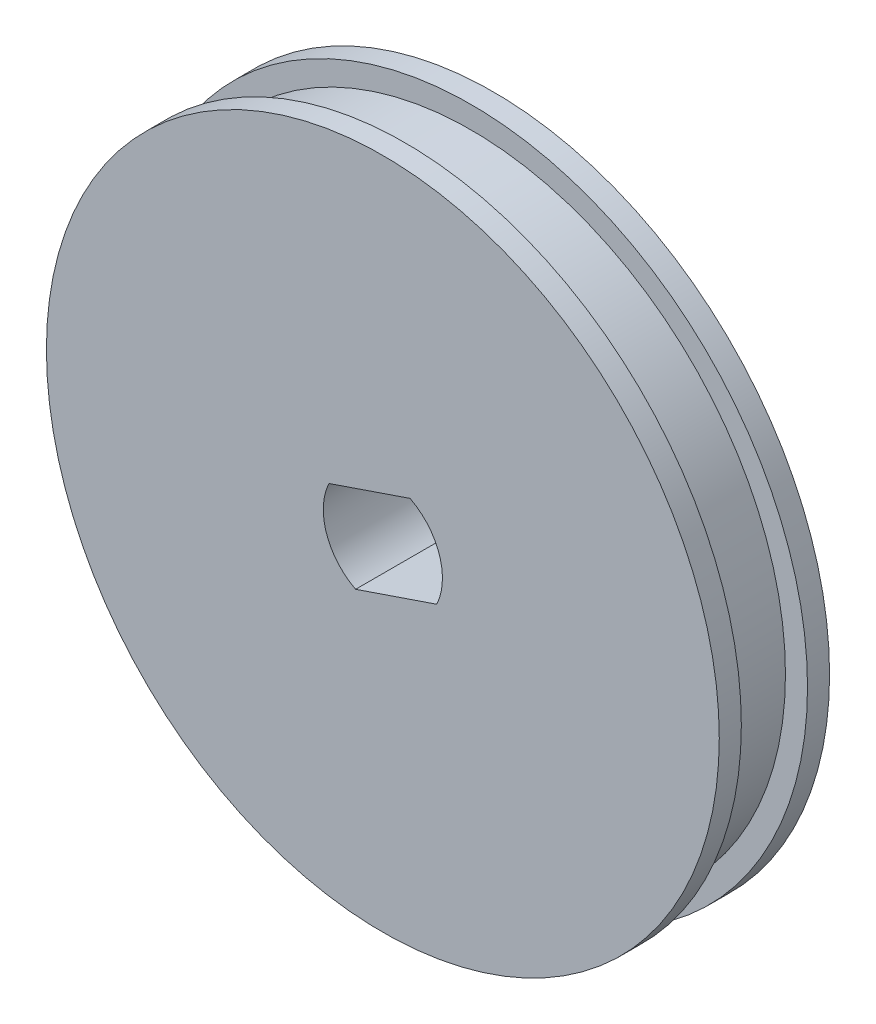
ISO-10303-21;
HEADER;
FILE_DESCRIPTION(('STEP AP214'),'2;1');
FILE_NAME('part.step','',(''),(''),'','','');
FILE_SCHEMA(('AUTOMOTIVE_DESIGN { 1 0 10303 214 1 1 1 1 }'));
ENDSEC;
DATA;
#1=APPLICATION_CONTEXT('core data for automotive mechanical design processes');
#2=APPLICATION_PROTOCOL_DEFINITION('international standard','automotive_design',2000,#1);
#3=PRODUCT_CONTEXT('',#1,'mechanical');
#4=PRODUCT('Part','Part','',(#3));
#5=PRODUCT_RELATED_PRODUCT_CATEGORY('part','',(#4));
#6=PRODUCT_DEFINITION_FORMATION('','',#4);
#7=PRODUCT_DEFINITION_CONTEXT('part definition',#1,'design');
#8=PRODUCT_DEFINITION('design','',#6,#7);
#9=PRODUCT_DEFINITION_SHAPE('','',#8);
#10=(LENGTH_UNIT() NAMED_UNIT(*) SI_UNIT(.MILLI.,.METRE.));
#11=(NAMED_UNIT(*) PLANE_ANGLE_UNIT() SI_UNIT($,.RADIAN.));
#12=(NAMED_UNIT(*) SI_UNIT($,.STERADIAN.) SOLID_ANGLE_UNIT());
#13=UNCERTAINTY_MEASURE_WITH_UNIT(LENGTH_MEASURE(1.E-05),#10,'distance_accuracy_value','');
#14=(GEOMETRIC_REPRESENTATION_CONTEXT(3) GLOBAL_UNCERTAINTY_ASSIGNED_CONTEXT((#13)) GLOBAL_UNIT_ASSIGNED_CONTEXT((#10,
#11,#12)) REPRESENTATION_CONTEXT('',''));
#15=CARTESIAN_POINT('',(0.,0.,0.));
#16=DIRECTION('',(0.,0.,1.));
#17=DIRECTION('',(1.,0.,0.));
#18=AXIS2_PLACEMENT_3D('',#15,#16,#17);
#19=CARTESIAN_POINT('',(22.4165324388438,-13.7076740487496,1.5));
#20=DIRECTION('',(0.,0.,-1.));
#21=DIRECTION('',(-1.,0.,0.));
#22=AXIS2_PLACEMENT_3D('',#19,#20,#21);
#23=CYLINDRICAL_SURFACE('',#22,14.25);
#24=CARTESIAN_POINT('',(22.4165324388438,-13.7076740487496,1.5));
#25=DIRECTION('',(0.,0.,1.));
#26=DIRECTION('',(1.,0.,0.));
#27=AXIS2_PLACEMENT_3D('',#24,#25,#26);
#28=CIRCLE('',#27,14.25);
#29=CARTESIAN_POINT('',(36.6665324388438,-13.7076740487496,1.5));
#30=VERTEX_POINT('',#29);
#31=EDGE_CURVE('E11',#30,#30,#28,.T.);
#32=ORIENTED_EDGE('',*,*,#31,.F.);
#33=EDGE_LOOP('',(#32));
#34=FACE_BOUND('',#33,.T.);
#35=CARTESIAN_POINT('',(22.4165324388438,-13.7076740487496,-1.5));
#36=DIRECTION('',(0.,0.,1.));
#37=DIRECTION('',(1.,0.,0.));
#38=AXIS2_PLACEMENT_3D('',#35,#36,#37);
#39=CIRCLE('',#38,14.25);
#40=CARTESIAN_POINT('',(36.6665324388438,-13.7076740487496,-1.5));
#41=VERTEX_POINT('',#40);
#42=EDGE_CURVE('E44',#41,#41,#39,.T.);
#43=ORIENTED_EDGE('',*,*,#42,.T.);
#44=EDGE_LOOP('',(#43));
#45=FACE_BOUND('',#44,.T.);
#46=ADVANCED_FACE('F41',(#34,#45),#23,.T.);
#47=CARTESIAN_POINT('',(22.4165324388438,-13.7076740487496,2.5));
#48=DIRECTION('',(0.,0.,-1.));
#49=DIRECTION('',(-1.,0.,0.));
#50=AXIS2_PLACEMENT_3D('',#47,#48,#49);
#51=CYLINDRICAL_SURFACE('',#50,15.25);
#52=CARTESIAN_POINT('',(22.4165324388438,-13.7076740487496,2.5));
#53=DIRECTION('',(0.,0.,1.));
#54=DIRECTION('',(1.,0.,0.));
#55=AXIS2_PLACEMENT_3D('',#52,#53,#54);
#56=CIRCLE('',#55,15.25);
#57=CARTESIAN_POINT('',(37.6665324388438,-13.7076740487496,2.5));
#58=VERTEX_POINT('',#57);
#59=EDGE_CURVE('E49',#58,#58,#56,.T.);
#60=ORIENTED_EDGE('',*,*,#59,.F.);
#61=EDGE_LOOP('',(#60));
#62=FACE_BOUND('',#61,.T.);
#63=CARTESIAN_POINT('',(22.4165324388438,-13.7076740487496,1.5));
#64=DIRECTION('',(0.,0.,1.));
#65=DIRECTION('',(1.,0.,0.));
#66=AXIS2_PLACEMENT_3D('',#63,#64,#65);
#67=CIRCLE('',#66,15.25);
#68=CARTESIAN_POINT('',(37.6665324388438,-13.7076740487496,1.5));
#69=VERTEX_POINT('',#68);
#70=EDGE_CURVE('E126',#69,#69,#67,.T.);
#71=ORIENTED_EDGE('',*,*,#70,.T.);
#72=EDGE_LOOP('',(#71));
#73=FACE_BOUND('',#72,.T.);
#74=ADVANCED_FACE('F155',(#62,#73),#51,.T.);
#75=CARTESIAN_POINT('',(22.4165324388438,-13.7076740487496,2.5));
#76=DIRECTION('',(0.,0.,1.));
#77=DIRECTION('',(1.,0.,0.));
#78=AXIS2_PLACEMENT_3D('',#75,#76,#77);
#79=PLANE('',#78);
#80=CARTESIAN_POINT('',(22.4165324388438,-13.7076740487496,2.5));
#81=DIRECTION('',(0.,0.,1.));
#82=DIRECTION('',(1.,0.,0.));
#83=AXIS2_PLACEMENT_3D('',#80,#81,#82);
#84=CIRCLE('',#83,2.7);
#85=CARTESIAN_POINT('',(24.8600789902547,-14.8561862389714,2.5));
#86=VERTEX_POINT('',#85);
#87=CARTESIAN_POINT('',(23.6510517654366,-11.3064322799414,2.5));
#88=VERTEX_POINT('',#87);
#89=EDGE_CURVE('E56',#86,#88,#84,.T.);
#90=ORIENTED_EDGE('',*,*,#89,.F.);
#91=DIRECTION('',(0.946601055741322,0.322407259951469,0.));
#92=VECTOR('',#91,1.);
#93=CARTESIAN_POINT('',(21.182013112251,-16.1089158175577,2.5));
#94=LINE('',#93,#92);
#95=CARTESIAN_POINT('',(21.182013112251,-16.1089158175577,2.5));
#96=VERTEX_POINT('',#95);
#97=EDGE_CURVE('E100',#96,#86,#94,.T.);
#98=ORIENTED_EDGE('',*,*,#97,.F.);
#99=CARTESIAN_POINT('',(22.4165324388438,-13.7076740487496,2.5));
#100=DIRECTION('',(0.,0.,1.));
#101=DIRECTION('',(1.,0.,0.));
#102=AXIS2_PLACEMENT_3D('',#99,#100,#101);
#103=CIRCLE('',#102,2.70000000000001);
#104=CARTESIAN_POINT('',(19.972985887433,-12.5591618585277,2.5));
#105=VERTEX_POINT('',#104);
#106=EDGE_CURVE('E103',#105,#96,#103,.T.);
#107=ORIENTED_EDGE('',*,*,#106,.F.);
#108=DIRECTION('',(-0.946601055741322,-0.322407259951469,0.));
#109=VECTOR('',#108,1.);
#110=CARTESIAN_POINT('',(23.6510517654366,-11.3064322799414,2.5));
#111=LINE('',#110,#109);
#112=EDGE_CURVE('E109',#88,#105,#111,.T.);
#113=ORIENTED_EDGE('',*,*,#112,.F.);
#114=EDGE_LOOP('',(#90,#98,#107,#113));
#115=FACE_BOUND('',#114,.T.);
#116=ORIENTED_EDGE('',*,*,#59,.T.);
#117=EDGE_LOOP('',(#116));
#118=FACE_BOUND('',#117,.T.);
#119=ADVANCED_FACE('F150',(#115,#118),#79,.T.);
#120=CARTESIAN_POINT('',(22.4165324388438,-13.7076740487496,1.5));
#121=DIRECTION('',(0.,0.,1.));
#122=DIRECTION('',(1.,0.,0.));
#123=AXIS2_PLACEMENT_3D('',#120,#121,#122);
#124=PLANE('',#123);
#125=ORIENTED_EDGE('',*,*,#31,.T.);
#126=EDGE_LOOP('',(#125));
#127=FACE_BOUND('',#126,.T.);
#128=ORIENTED_EDGE('',*,*,#70,.F.);
#129=EDGE_LOOP('',(#128));
#130=FACE_BOUND('',#129,.T.);
#131=ADVANCED_FACE('F142',(#127,#130),#124,.F.);
#132=CARTESIAN_POINT('',(22.4165324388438,-13.7076740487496,-2.5));
#133=DIRECTION('',(0.,0.,1.));
#134=DIRECTION('',(1.,0.,0.));
#135=AXIS2_PLACEMENT_3D('',#132,#133,#134);
#136=CYLINDRICAL_SURFACE('',#135,15.25);
#137=CARTESIAN_POINT('',(22.4165324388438,-13.7076740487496,-2.5));
#138=DIRECTION('',(0.,0.,1.));
#139=DIRECTION('',(1.,0.,0.));
#140=AXIS2_PLACEMENT_3D('',#137,#138,#139);
#141=CIRCLE('',#140,15.25);
#142=CARTESIAN_POINT('',(37.6665324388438,-13.7076740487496,-2.5));
#143=VERTEX_POINT('',#142);
#144=EDGE_CURVE('E119',#143,#143,#141,.T.);
#145=ORIENTED_EDGE('',*,*,#144,.T.);
#146=EDGE_LOOP('',(#145));
#147=FACE_BOUND('',#146,.T.);
#148=CARTESIAN_POINT('',(22.4165324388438,-13.7076740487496,-1.5));
#149=DIRECTION('',(0.,0.,1.));
#150=DIRECTION('',(1.,0.,0.));
#151=AXIS2_PLACEMENT_3D('',#148,#149,#150);
#152=CIRCLE('',#151,15.25);
#153=CARTESIAN_POINT('',(37.6665324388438,-13.7076740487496,-1.5));
#154=VERTEX_POINT('',#153);
#155=EDGE_CURVE('E115',#154,#154,#152,.T.);
#156=ORIENTED_EDGE('',*,*,#155,.F.);
#157=EDGE_LOOP('',(#156));
#158=FACE_BOUND('',#157,.T.);
#159=ADVANCED_FACE('F140',(#147,#158),#136,.T.);
#160=CARTESIAN_POINT('',(22.4165324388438,-13.7076740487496,-2.5));
#161=DIRECTION('',(0.,0.,-1.));
#162=DIRECTION('',(1.,0.,0.));
#163=AXIS2_PLACEMENT_3D('',#160,#161,#162);
#164=PLANE('',#163);
#165=CARTESIAN_POINT('',(22.4165324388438,-13.7076740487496,-2.5));
#166=DIRECTION('',(0.,0.,1.));
#167=DIRECTION('',(1.,0.,0.));
#168=AXIS2_PLACEMENT_3D('',#165,#166,#167);
#169=CIRCLE('',#168,2.7);
#170=CARTESIAN_POINT('',(24.8600789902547,-14.8561862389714,-2.5));
#171=VERTEX_POINT('',#170);
#172=CARTESIAN_POINT('',(23.6510517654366,-11.3064322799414,-2.5));
#173=VERTEX_POINT('',#172);
#174=EDGE_CURVE('E84',#171,#173,#169,.T.);
#175=ORIENTED_EDGE('',*,*,#174,.T.);
#176=DIRECTION('',(-0.946601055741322,-0.322407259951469,0.));
#177=VECTOR('',#176,1.);
#178=CARTESIAN_POINT('',(23.6510517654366,-11.3064322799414,-2.5));
#179=LINE('',#178,#177);
#180=CARTESIAN_POINT('',(19.972985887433,-12.5591618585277,-2.5));
#181=VERTEX_POINT('',#180);
#182=EDGE_CURVE('E93',#173,#181,#179,.T.);
#183=ORIENTED_EDGE('',*,*,#182,.T.);
#184=CARTESIAN_POINT('',(22.4165324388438,-13.7076740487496,-2.5));
#185=DIRECTION('',(0.,0.,1.));
#186=DIRECTION('',(1.,0.,0.));
#187=AXIS2_PLACEMENT_3D('',#184,#185,#186);
#188=CIRCLE('',#187,2.70000000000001);
#189=CARTESIAN_POINT('',(21.182013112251,-16.1089158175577,-2.5));
#190=VERTEX_POINT('',#189);
#191=EDGE_CURVE('E64',#181,#190,#188,.T.);
#192=ORIENTED_EDGE('',*,*,#191,.T.);
#193=DIRECTION('',(0.946601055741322,0.322407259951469,0.));
#194=VECTOR('',#193,1.);
#195=CARTESIAN_POINT('',(21.182013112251,-16.1089158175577,-2.5));
#196=LINE('',#195,#194);
#197=EDGE_CURVE('E90',#190,#171,#196,.T.);
#198=ORIENTED_EDGE('',*,*,#197,.T.);
#199=EDGE_LOOP('',(#175,#183,#192,#198));
#200=FACE_BOUND('',#199,.T.);
#201=ORIENTED_EDGE('',*,*,#144,.F.);
#202=EDGE_LOOP('',(#201));
#203=FACE_BOUND('',#202,.T.);
#204=ADVANCED_FACE('F97',(#200,#203),#164,.T.);
#205=CARTESIAN_POINT('',(22.4165324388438,-13.7076740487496,-1.5));
#206=DIRECTION('',(0.,0.,-1.));
#207=DIRECTION('',(1.,0.,0.));
#208=AXIS2_PLACEMENT_3D('',#205,#206,#207);
#209=PLANE('',#208);
#210=ORIENTED_EDGE('',*,*,#42,.F.);
#211=EDGE_LOOP('',(#210));
#212=FACE_BOUND('',#211,.T.);
#213=ORIENTED_EDGE('',*,*,#155,.T.);
#214=EDGE_LOOP('',(#213));
#215=FACE_BOUND('',#214,.T.);
#216=ADVANCED_FACE('F134',(#212,#215),#209,.F.);
#217=CARTESIAN_POINT('',(22.4165324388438,-13.7076740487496,-2.5));
#218=DIRECTION('',(0.,0.,1.));
#219=DIRECTION('',(1.,0.,0.));
#220=AXIS2_PLACEMENT_3D('',#217,#218,#219);
#221=CYLINDRICAL_SURFACE('',#220,2.7);
#222=ORIENTED_EDGE('',*,*,#89,.T.);
#223=DIRECTION('',(0.,0.,1.));
#224=VECTOR('',#223,1.);
#225=CARTESIAN_POINT('',(23.6510517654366,-11.3064322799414,-2.5));
#226=LINE('',#225,#224);
#227=EDGE_CURVE('E80',#173,#88,#226,.T.);
#228=ORIENTED_EDGE('',*,*,#227,.F.);
#229=ORIENTED_EDGE('',*,*,#174,.F.);
#230=DIRECTION('',(0.,0.,1.));
#231=VECTOR('',#230,1.);
#232=CARTESIAN_POINT('',(24.8600789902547,-14.8561862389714,-2.5));
#233=LINE('',#232,#231);
#234=EDGE_CURVE('E113',#171,#86,#233,.T.);
#235=ORIENTED_EDGE('',*,*,#234,.T.);
#236=EDGE_LOOP('',(#222,#228,#229,#235));
#237=FACE_BOUND('',#236,.T.);
#238=ADVANCED_FACE('F82',(#237),#221,.F.);
#239=CARTESIAN_POINT('',(21.182013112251,-16.1089158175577,-2.5));
#240=DIRECTION('',(0.322407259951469,-0.946601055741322,0.));
#241=DIRECTION('',(0.946601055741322,0.322407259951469,0.));
#242=AXIS2_PLACEMENT_3D('',#239,#240,#241);
#243=PLANE('',#242);
#244=ORIENTED_EDGE('',*,*,#97,.T.);
#245=ORIENTED_EDGE('',*,*,#234,.F.);
#246=ORIENTED_EDGE('',*,*,#197,.F.);
#247=DIRECTION('',(0.,0.,1.));
#248=VECTOR('',#247,1.);
#249=CARTESIAN_POINT('',(21.182013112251,-16.1089158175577,-2.5));
#250=LINE('',#249,#248);
#251=EDGE_CURVE('E116',#190,#96,#250,.T.);
#252=ORIENTED_EDGE('',*,*,#251,.T.);
#253=EDGE_LOOP('',(#244,#245,#246,#252));
#254=FACE_BOUND('',#253,.T.);
#255=ADVANCED_FACE('F175',(#254),#243,.F.);
#256=CARTESIAN_POINT('',(22.4165324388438,-13.7076740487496,-2.5));
#257=DIRECTION('',(0.,0.,1.));
#258=DIRECTION('',(1.,0.,0.));
#259=AXIS2_PLACEMENT_3D('',#256,#257,#258);
#260=CYLINDRICAL_SURFACE('',#259,2.70000000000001);
#261=ORIENTED_EDGE('',*,*,#106,.T.);
#262=ORIENTED_EDGE('',*,*,#251,.F.);
#263=ORIENTED_EDGE('',*,*,#191,.F.);
#264=DIRECTION('',(0.,0.,1.));
#265=VECTOR('',#264,1.);
#266=CARTESIAN_POINT('',(19.972985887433,-12.5591618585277,-2.5));
#267=LINE('',#266,#265);
#268=EDGE_CURVE('E89',#181,#105,#267,.T.);
#269=ORIENTED_EDGE('',*,*,#268,.T.);
#270=EDGE_LOOP('',(#261,#262,#263,#269));
#271=FACE_BOUND('',#270,.T.);
#272=ADVANCED_FACE('F173',(#271),#260,.F.);
#273=CARTESIAN_POINT('',(23.6510517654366,-11.3064322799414,-2.5));
#274=DIRECTION('',(-0.322407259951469,0.946601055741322,0.));
#275=DIRECTION('',(-0.946601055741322,-0.322407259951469,0.));
#276=AXIS2_PLACEMENT_3D('',#273,#274,#275);
#277=PLANE('',#276);
#278=ORIENTED_EDGE('',*,*,#112,.T.);
#279=ORIENTED_EDGE('',*,*,#268,.F.);
#280=ORIENTED_EDGE('',*,*,#182,.F.);
#281=ORIENTED_EDGE('',*,*,#227,.T.);
#282=EDGE_LOOP('',(#278,#279,#280,#281));
#283=FACE_BOUND('',#282,.T.);
#284=ADVANCED_FACE('F94',(#283),#277,.F.);
#285=CLOSED_SHELL('',(#46,#74,#119,#131,#159,#204,#216,#238,#255,#272,#284));
#286=MANIFOLD_SOLID_BREP('B2',#285);
#287=ADVANCED_BREP_SHAPE_REPRESENTATION('',(#18,#286),#14);
#288=SHAPE_DEFINITION_REPRESENTATION(#9,#287);
ENDSEC;
END-ISO-10303-21;
